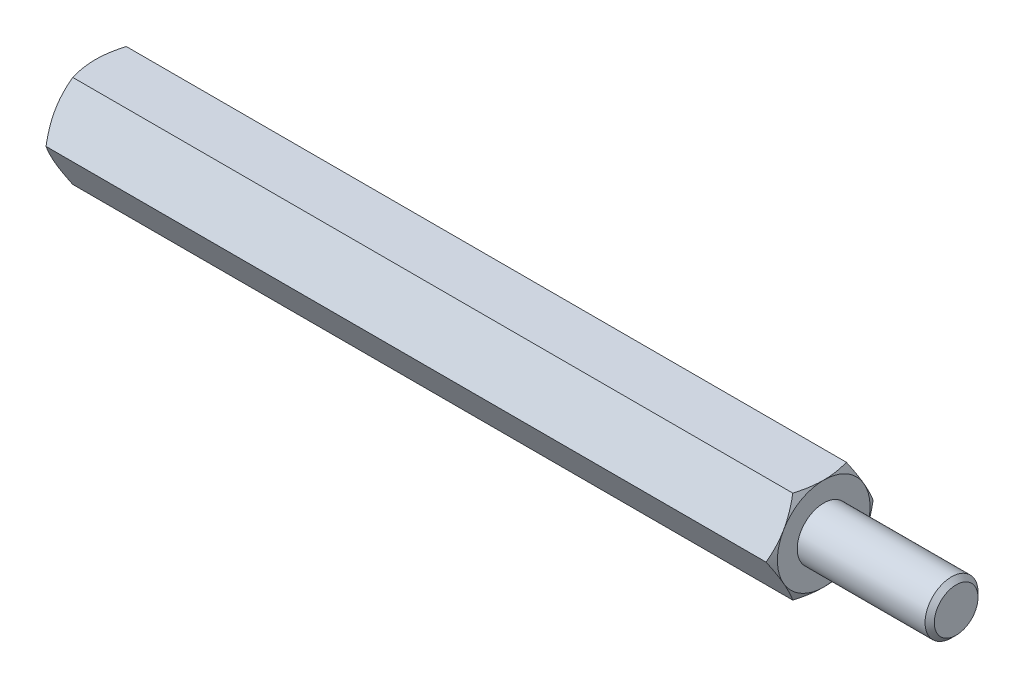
ISO-10303-21;
HEADER;
FILE_DESCRIPTION(('STEP AP214'),'2;1');
FILE_NAME('part.step','',(''),(''),'','','');
FILE_SCHEMA(('AUTOMOTIVE_DESIGN { 1 0 10303 214 1 1 1 1 }'));
ENDSEC;
DATA;
#1=APPLICATION_CONTEXT('core data for automotive mechanical design processes');
#2=APPLICATION_PROTOCOL_DEFINITION('international standard','automotive_design',2000,#1);
#3=PRODUCT_CONTEXT('',#1,'mechanical');
#4=PRODUCT('Part','Part','',(#3));
#5=PRODUCT_RELATED_PRODUCT_CATEGORY('part','',(#4));
#6=PRODUCT_DEFINITION_FORMATION('','',#4);
#7=PRODUCT_DEFINITION_CONTEXT('part definition',#1,'design');
#8=PRODUCT_DEFINITION('design','',#6,#7);
#9=PRODUCT_DEFINITION_SHAPE('','',#8);
#10=(LENGTH_UNIT() NAMED_UNIT(*) SI_UNIT(.MILLI.,.METRE.));
#11=(NAMED_UNIT(*) PLANE_ANGLE_UNIT() SI_UNIT($,.RADIAN.));
#12=(NAMED_UNIT(*) SI_UNIT($,.STERADIAN.) SOLID_ANGLE_UNIT());
#13=UNCERTAINTY_MEASURE_WITH_UNIT(LENGTH_MEASURE(1.E-05),#10,'distance_accuracy_value','');
#14=(GEOMETRIC_REPRESENTATION_CONTEXT(3) GLOBAL_UNCERTAINTY_ASSIGNED_CONTEXT((#13)) GLOBAL_UNIT_ASSIGNED_CONTEXT((#10,
#11,#12)) REPRESENTATION_CONTEXT('',''));
#15=CARTESIAN_POINT('',(0.,0.,0.));
#16=DIRECTION('',(0.,0.,1.));
#17=DIRECTION('',(1.,0.,0.));
#18=AXIS2_PLACEMENT_3D('',#15,#16,#17);
#19=CARTESIAN_POINT('',(27.5,3.5,-2.02072594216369));
#20=DIRECTION('',(1.,0.,0.));
#21=DIRECTION('',(0.,0.,-1.));
#22=AXIS2_PLACEMENT_3D('',#19,#20,#21);
#23=PLANE('',#22);
#24=CARTESIAN_POINT('',(27.5,0.,0.));
#25=DIRECTION('',(1.,0.,0.));
#26=DIRECTION('',(0.,0.,-1.));
#27=AXIS2_PLACEMENT_3D('',#24,#25,#26);
#28=CIRCLE('',#27,3.5);
#29=CARTESIAN_POINT('',(27.5,-1.75,-3.03108891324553));
#30=VERTEX_POINT('',#29);
#31=CARTESIAN_POINT('',(27.5,1.75,-3.03108891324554));
#32=VERTEX_POINT('',#31);
#33=EDGE_CURVE('E288',#30,#32,#28,.T.);
#34=ORIENTED_EDGE('',*,*,#33,.T.);
#35=CARTESIAN_POINT('',(27.5,3.5,0.));
#36=VERTEX_POINT('',#35);
#37=EDGE_CURVE('E53',#32,#36,#28,.T.);
#38=ORIENTED_EDGE('',*,*,#37,.T.);
#39=CARTESIAN_POINT('',(27.5,1.75,3.03108891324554));
#40=VERTEX_POINT('',#39);
#41=EDGE_CURVE('E297',#36,#40,#28,.T.);
#42=ORIENTED_EDGE('',*,*,#41,.T.);
#43=CARTESIAN_POINT('',(27.5,-1.75000000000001,3.03108891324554));
#44=VERTEX_POINT('',#43);
#45=EDGE_CURVE('E302',#40,#44,#28,.T.);
#46=ORIENTED_EDGE('',*,*,#45,.T.);
#47=CARTESIAN_POINT('',(27.5,0.,0.));
#48=DIRECTION('',(-1.,0.,0.));
#49=DIRECTION('',(0.,-1.,0.));
#50=AXIS2_PLACEMENT_3D('',#47,#48,#49);
#51=CIRCLE('',#50,3.5);
#52=CARTESIAN_POINT('',(27.5,-3.50000000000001,0.));
#53=VERTEX_POINT('',#52);
#54=EDGE_CURVE('E193',#53,#44,#51,.T.);
#55=ORIENTED_EDGE('',*,*,#54,.F.);
#56=EDGE_CURVE('E61',#53,#30,#28,.T.);
#57=ORIENTED_EDGE('',*,*,#56,.T.);
#58=EDGE_LOOP('',(#34,#38,#42,#46,#55,#57));
#59=FACE_BOUND('',#58,.T.);
#60=CARTESIAN_POINT('',(27.5,0.,0.));
#61=DIRECTION('',(1.,0.,0.));
#62=DIRECTION('',(0.,0.,-1.));
#63=AXIS2_PLACEMENT_3D('',#60,#61,#62);
#64=CIRCLE('',#63,2.);
#65=CARTESIAN_POINT('',(27.5,0.,-2.));
#66=VERTEX_POINT('',#65);
#67=EDGE_CURVE('E407',#66,#66,#64,.T.);
#68=ORIENTED_EDGE('',*,*,#67,.F.);
#69=EDGE_LOOP('',(#68));
#70=FACE_BOUND('',#69,.T.);
#71=ADVANCED_FACE('F37',(#59,#70),#23,.T.);
#72=CARTESIAN_POINT('',(27.5,0.,-4.04145188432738));
#73=DIRECTION('',(0.,-0.5,0.866025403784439));
#74=DIRECTION('',(0.,-0.866025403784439,-0.5));
#75=AXIS2_PLACEMENT_3D('',#72,#73,#74);
#76=PLANE('',#75);
#77=CARTESIAN_POINT('',(27.1873259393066,-0.000200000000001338,-4.04156735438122));
#78=CARTESIAN_POINT('',(27.23861421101,0.153607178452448,-3.9527667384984));
#79=CARTESIAN_POINT('',(27.2852590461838,0.308742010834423,-3.86319960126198));
#80=CARTESIAN_POINT('',(27.3666781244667,0.621698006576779,-3.68251437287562));
#81=CARTESIAN_POINT('',(27.4014235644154,0.779524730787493,-3.59139307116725));
#82=CARTESIAN_POINT('',(27.4555099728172,1.09322221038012,-3.41027974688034));
#83=CARTESIAN_POINT('',(27.4752109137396,1.24904469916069,-3.32031559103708));
#84=CARTESIAN_POINT('',(27.4987298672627,1.56142288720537,-3.13996396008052));
#85=CARTESIAN_POINT('',(27.5025673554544,1.71797745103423,-3.04957714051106));
#86=CARTESIAN_POINT('',(27.494584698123,2.01050921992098,-2.88068384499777));
#87=CARTESIAN_POINT('',(27.4847245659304,2.1465302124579,-2.80215208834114));
#88=CARTESIAN_POINT('',(27.4534735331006,2.41768602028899,-2.64560020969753));
#89=CARTESIAN_POINT('',(27.4320719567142,2.55281989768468,-2.5675806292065));
#90=CARTESIAN_POINT('',(27.3785695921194,2.82453479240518,-2.41070596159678));
#91=CARTESIAN_POINT('',(27.3462420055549,2.96108141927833,-2.33187072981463));
#92=CARTESIAN_POINT('',(27.272871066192,3.2321380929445,-2.17537608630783));
#93=CARTESIAN_POINT('',(27.2318449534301,3.36665161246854,-2.09771466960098));
#94=CARTESIAN_POINT('',(27.1873259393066,3.5002,-2.02061047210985));
#95=B_SPLINE_CURVE_WITH_KNOTS('',3,(#77,#78,#79,#80,#81,#82,#83,#84,#85,#86,#87,#88,#89,#90,#91,
#92,#93,#94),.UNSPECIFIED.,.F.,.F.,(4,2,2,2,2,2,2,2,4),(0.,0.554793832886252,1.11092123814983,
1.65328467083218,2.19498204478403,2.6666513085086,3.13875761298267,3.62133612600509,
4.10296698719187),.UNSPECIFIED.);
#96=CARTESIAN_POINT('',(27.1873926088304,0.,-4.04145188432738));
#97=VERTEX_POINT('',#96);
#98=EDGE_CURVE('E353',#97,#32,#95,.T.);
#99=ORIENTED_EDGE('',*,*,#98,.F.);
#100=DIRECTION('',(-1.,0.,0.));
#101=VECTOR('',#100,1.);
#102=CARTESIAN_POINT('',(27.5,0.,-4.04145188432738));
#103=LINE('',#102,#101);
#104=CARTESIAN_POINT('',(-27.1873926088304,0.,-4.04145188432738));
#105=VERTEX_POINT('',#104);
#106=EDGE_CURVE('E264',#97,#105,#103,.T.);
#107=ORIENTED_EDGE('',*,*,#106,.T.);
#108=CARTESIAN_POINT('',(-27.1873259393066,3.5002,-2.02061047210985));
#109=CARTESIAN_POINT('',(-27.23861421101,3.34639282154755,-2.10941108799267));
#110=CARTESIAN_POINT('',(-27.2852590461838,3.19125798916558,-2.19897822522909));
#111=CARTESIAN_POINT('',(-27.3666781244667,2.87830199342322,-2.37966345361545));
#112=CARTESIAN_POINT('',(-27.4014235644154,2.7204752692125,-2.47078475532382));
#113=CARTESIAN_POINT('',(-27.4555099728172,2.40677778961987,-2.65189807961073));
#114=CARTESIAN_POINT('',(-27.4752109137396,2.25095530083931,-2.74186223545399));
#115=CARTESIAN_POINT('',(-27.4987298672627,1.93857711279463,-2.92221386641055));
#116=CARTESIAN_POINT('',(-27.5025673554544,1.78202254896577,-3.01260068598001));
#117=CARTESIAN_POINT('',(-27.494584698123,1.48949078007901,-3.1814939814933));
#118=CARTESIAN_POINT('',(-27.4847245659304,1.35346978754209,-3.26002573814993));
#119=CARTESIAN_POINT('',(-27.4534735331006,1.082313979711,-3.41657761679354));
#120=CARTESIAN_POINT('',(-27.4320719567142,0.947180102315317,-3.49459719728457));
#121=CARTESIAN_POINT('',(-27.3785695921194,0.675465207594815,-3.65147186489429));
#122=CARTESIAN_POINT('',(-27.3462420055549,0.538918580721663,-3.73030709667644));
#123=CARTESIAN_POINT('',(-27.272871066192,0.267861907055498,-3.88680174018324));
#124=CARTESIAN_POINT('',(-27.2318449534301,0.133348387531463,-3.96446315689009));
#125=CARTESIAN_POINT('',(-27.1873259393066,-0.000200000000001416,-4.04156735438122));
#126=B_SPLINE_CURVE_WITH_KNOTS('',3,(#108,#109,#110,#111,#112,#113,#114,#115,#116,#117,#118,
#119,#120,#121,#122,#123,#124,#125),.UNSPECIFIED.,.F.,.F.,(4,2,2,2,2,2,2,2,4),(0.,
0.554793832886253,1.11092123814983,1.65328467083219,2.19498204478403,2.6666513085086,
3.13875761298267,3.6213361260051,4.10296698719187),.UNSPECIFIED.);
#127=CARTESIAN_POINT('',(-27.5,1.75,-3.03108891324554));
#128=VERTEX_POINT('',#127);
#129=EDGE_CURVE('E322',#128,#105,#126,.T.);
#130=ORIENTED_EDGE('',*,*,#129,.F.);
#131=CARTESIAN_POINT('',(-27.1873926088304,3.5,-2.02072594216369));
#132=VERTEX_POINT('',#131);
#133=EDGE_CURVE('E320',#132,#128,#126,.T.);
#134=ORIENTED_EDGE('',*,*,#133,.F.);
#135=DIRECTION('',(-1.,0.,0.));
#136=VECTOR('',#135,1.);
#137=CARTESIAN_POINT('',(27.5,3.5,-2.02072594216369));
#138=LINE('',#137,#136);
#139=CARTESIAN_POINT('',(27.1873926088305,3.5,-2.02072594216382));
#140=VERTEX_POINT('',#139);
#141=EDGE_CURVE('E279',#140,#132,#138,.T.);
#142=ORIENTED_EDGE('',*,*,#141,.F.);
#143=EDGE_CURVE('E229',#32,#140,#95,.T.);
#144=ORIENTED_EDGE('',*,*,#143,.F.);
#145=EDGE_LOOP('',(#99,#107,#130,#134,#142,#144));
#146=FACE_BOUND('',#145,.T.);
#147=ADVANCED_FACE('F148',(#146),#76,.F.);
#148=CARTESIAN_POINT('',(27.5,3.5,-2.02072594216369));
#149=DIRECTION('',(0.,-1.,0.));
#150=DIRECTION('',(0.,0.,-1.));
#151=AXIS2_PLACEMENT_3D('',#148,#149,#150);
#152=PLANE('',#151);
#153=CARTESIAN_POINT('',(25.7443294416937,3.5,-5.525713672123));
#154=CARTESIAN_POINT('',(25.8192813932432,3.5,-5.37200190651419));
#155=CARTESIAN_POINT('',(25.8935424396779,3.5,-5.21794762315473));
#156=CARTESIAN_POINT('',(26.0402960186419,3.5,-4.90897223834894));
#157=CARTESIAN_POINT('',(26.1127882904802,3.5,-4.75405101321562));
#158=CARTESIAN_POINT('',(26.2559617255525,3.5,-4.44240758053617));
#159=CARTESIAN_POINT('',(26.3266316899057,3.5,-4.28568021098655));
#160=CARTESIAN_POINT('',(26.4652074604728,3.5,-3.97101270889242));
#161=CARTESIAN_POINT('',(26.5331133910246,3.5,-3.81307263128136));
#162=CARTESIAN_POINT('',(26.6677143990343,3.5,-3.49026114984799));
#163=CARTESIAN_POINT('',(26.7342871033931,3.5,-3.32533845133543));
#164=CARTESIAN_POINT('',(26.8626267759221,3.5,-2.99359992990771));
#165=CARTESIAN_POINT('',(26.9243932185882,3.5,-2.82678390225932));
#166=CARTESIAN_POINT('',(27.0415700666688,3.5,-2.49127529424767));
#167=CARTESIAN_POINT('',(27.0969925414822,3.5,-2.32258697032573));
#168=CARTESIAN_POINT('',(27.1997679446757,3.5,-1.98279215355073));
#169=CARTESIAN_POINT('',(27.2471233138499,3.5,-1.81168640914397));
#170=CARTESIAN_POINT('',(27.3312987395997,3.5,-1.46793354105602));
#171=CARTESIAN_POINT('',(27.3681796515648,3.5,-1.2953015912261));
#172=CARTESIAN_POINT('',(27.4293955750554,3.5,-0.94779164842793));
#173=CARTESIAN_POINT('',(27.453731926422,3.5,-0.772913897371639));
#174=CARTESIAN_POINT('',(27.4876038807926,3.5,-0.424108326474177));
#175=CARTESIAN_POINT('',(27.497337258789,3.5,-0.250200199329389));
#176=CARTESIAN_POINT('',(27.5017053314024,3.5,0.0978233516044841));
#177=CARTESIAN_POINT('',(27.4963399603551,3.5,0.271938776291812));
#178=CARTESIAN_POINT('',(27.4750118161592,3.5,0.564711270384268));
#179=CARTESIAN_POINT('',(27.4628919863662,3.5,0.683667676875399));
#180=CARTESIAN_POINT('',(27.4323080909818,3.5,0.920767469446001));
#181=CARTESIAN_POINT('',(27.4138432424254,3.5,1.03891075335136));
#182=CARTESIAN_POINT('',(27.3498956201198,3.5,1.39193174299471));
#183=CARTESIAN_POINT('',(27.2958695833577,3.5,1.62528232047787));
#184=CARTESIAN_POINT('',(27.2014515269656,3.5,1.97433825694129));
#185=CARTESIAN_POINT('',(27.1672900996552,3.5,2.09183268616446));
#186=CARTESIAN_POINT('',(27.095234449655,3.5,2.32568238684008));
#187=CARTESIAN_POINT('',(27.0573401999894,3.5,2.44203765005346));
#188=CARTESIAN_POINT('',(26.9784421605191,3.5,2.6736423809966));
#189=CARTESIAN_POINT('',(26.9374392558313,3.5,2.78889215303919));
#190=CARTESIAN_POINT('',(26.852824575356,3.5,3.01842460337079));
#191=CARTESIAN_POINT('',(26.8092128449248,3.5,3.1327072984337));
#192=CARTESIAN_POINT('',(26.6958241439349,3.5,3.42150510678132));
#193=CARTESIAN_POINT('',(26.6245636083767,3.5,3.59543696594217));
#194=CARTESIAN_POINT('',(26.4781026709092,3.5,3.94163961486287));
#195=CARTESIAN_POINT('',(26.4029019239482,3.5,4.11391025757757));
#196=CARTESIAN_POINT('',(26.2494252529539,3.5,4.45713072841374));
#197=CARTESIAN_POINT('',(26.1711484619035,3.5,4.62808016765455));
#198=CARTESIAN_POINT('',(26.012188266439,3.5,4.9688584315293));
#199=CARTESIAN_POINT('',(25.9315047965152,3.5,5.13868722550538));
#200=CARTESIAN_POINT('',(25.6863871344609,3.5,5.64726192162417));
#201=CARTESIAN_POINT('',(25.5190975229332,3.5,5.98463020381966));
#202=CARTESIAN_POINT('',(25.1795854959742,3.5,6.65678495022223));
#203=CARTESIAN_POINT('',(25.0073639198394,3.5,6.99157184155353));
#204=CARTESIAN_POINT('',(24.6760800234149,3.5,7.62749570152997));
#205=CARTESIAN_POINT('',(24.5173299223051,3.5,7.92879562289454));
#206=CARTESIAN_POINT('',(24.1977473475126,3.5,8.53030635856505));
#207=CARTESIAN_POINT('',(24.0369147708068,3.5,8.83051711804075));
#208=CARTESIAN_POINT('',(23.7141792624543,3.5,9.42918006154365));
#209=CARTESIAN_POINT('',(23.5522810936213,3.5,9.72763481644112));
#210=CARTESIAN_POINT('',(23.2272737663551,3.5,10.3238577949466));
#211=CARTESIAN_POINT('',(23.0641646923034,3.5,10.6216260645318));
#212=CARTESIAN_POINT('',(22.9006104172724,3.5,10.9191478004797));
#213=B_SPLINE_CURVE_WITH_KNOTS('',3,(#153,#154,#155,#156,#157,#158,#159,#160,#161,#162,#163,
#164,#165,#166,#167,#168,#169,#170,#171,#172,#173,#174,#175,#176,#177,#178,#179,#180,#181,#182,
#183,#184,#185,#186,#187,#188,#189,#190,#191,#192,#193,#194,#195,#196,#197,#198,#199,#200,#201,
#202,#203,#204,#205,#206,#207,#208,#209,#210,#211,#212),.UNSPECIFIED.,.F.,.F.,(4,2,2,2,2,2,2,2,
2,2,2,2,2,2,2,2,2,2,2,2,2,2,2,2,2,2,2,2,2,4),(0.,0.513041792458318,1.02615874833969,
1.54190801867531,2.05763406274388,2.59113284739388,3.1246898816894,3.65721433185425,
4.18957737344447,4.71878103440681,5.24792816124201,5.76984197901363,6.29175806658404,
6.65030258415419,7.00889136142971,7.72642330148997,8.09346920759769,8.46051776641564,
8.82746220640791,9.19440026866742,9.7582223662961,10.3220939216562,10.8861255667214,
11.4501725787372,12.579801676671,13.7092396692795,14.730918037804,15.7526471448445,
16.771258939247,17.7898004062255),.UNSPECIFIED.);
#214=EDGE_CURVE('E227',#140,#36,#213,.T.);
#215=ORIENTED_EDGE('',*,*,#214,.F.);
#216=ORIENTED_EDGE('',*,*,#141,.T.);
#217=CARTESIAN_POINT('',(-25.7443294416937,3.5,-5.525713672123));
#218=CARTESIAN_POINT('',(-25.8192813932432,3.5,-5.37200190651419));
#219=CARTESIAN_POINT('',(-25.8935424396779,3.5,-5.21794762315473));
#220=CARTESIAN_POINT('',(-26.0402960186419,3.5,-4.90897223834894));
#221=CARTESIAN_POINT('',(-26.1127882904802,3.5,-4.75405101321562));
#222=CARTESIAN_POINT('',(-26.2559617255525,3.5,-4.44240758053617));
#223=CARTESIAN_POINT('',(-26.3266316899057,3.5,-4.28568021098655));
#224=CARTESIAN_POINT('',(-26.4652074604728,3.5,-3.97101270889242));
#225=CARTESIAN_POINT('',(-26.5331133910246,3.5,-3.81307263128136));
#226=CARTESIAN_POINT('',(-26.6677143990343,3.5,-3.49026114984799));
#227=CARTESIAN_POINT('',(-26.7342871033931,3.5,-3.32533845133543));
#228=CARTESIAN_POINT('',(-26.8626267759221,3.5,-2.99359992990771));
#229=CARTESIAN_POINT('',(-26.9243932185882,3.5,-2.82678390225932));
#230=CARTESIAN_POINT('',(-27.0415700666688,3.5,-2.49127529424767));
#231=CARTESIAN_POINT('',(-27.0969925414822,3.5,-2.32258697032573));
#232=CARTESIAN_POINT('',(-27.1997679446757,3.5,-1.98279215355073));
#233=CARTESIAN_POINT('',(-27.2471233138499,3.5,-1.81168640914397));
#234=CARTESIAN_POINT('',(-27.3312987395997,3.5,-1.46793354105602));
#235=CARTESIAN_POINT('',(-27.3681796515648,3.5,-1.2953015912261));
#236=CARTESIAN_POINT('',(-27.4293955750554,3.5,-0.94779164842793));
#237=CARTESIAN_POINT('',(-27.453731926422,3.5,-0.772913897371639));
#238=CARTESIAN_POINT('',(-27.4876038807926,3.5,-0.424108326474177));
#239=CARTESIAN_POINT('',(-27.497337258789,3.5,-0.250200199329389));
#240=CARTESIAN_POINT('',(-27.5017053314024,3.5,0.0978233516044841));
#241=CARTESIAN_POINT('',(-27.4963399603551,3.5,0.271938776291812));
#242=CARTESIAN_POINT('',(-27.4750118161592,3.5,0.564711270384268));
#243=CARTESIAN_POINT('',(-27.4628919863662,3.5,0.683667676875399));
#244=CARTESIAN_POINT('',(-27.4323080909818,3.5,0.920767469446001));
#245=CARTESIAN_POINT('',(-27.4138432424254,3.5,1.03891075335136));
#246=CARTESIAN_POINT('',(-27.3498956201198,3.5,1.39193174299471));
#247=CARTESIAN_POINT('',(-27.2958695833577,3.5,1.62528232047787));
#248=CARTESIAN_POINT('',(-27.2014515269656,3.5,1.97433825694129));
#249=CARTESIAN_POINT('',(-27.1672900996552,3.5,2.09183268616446));
#250=CARTESIAN_POINT('',(-27.095234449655,3.5,2.32568238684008));
#251=CARTESIAN_POINT('',(-27.0573401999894,3.5,2.44203765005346));
#252=CARTESIAN_POINT('',(-26.9784421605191,3.5,2.6736423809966));
#253=CARTESIAN_POINT('',(-26.9374392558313,3.5,2.78889215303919));
#254=CARTESIAN_POINT('',(-26.852824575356,3.5,3.01842460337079));
#255=CARTESIAN_POINT('',(-26.8092128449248,3.5,3.1327072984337));
#256=CARTESIAN_POINT('',(-26.6958241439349,3.5,3.42150510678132));
#257=CARTESIAN_POINT('',(-26.6245636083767,3.5,3.59543696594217));
#258=CARTESIAN_POINT('',(-26.4781026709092,3.5,3.94163961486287));
#259=CARTESIAN_POINT('',(-26.4029019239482,3.5,4.11391025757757));
#260=CARTESIAN_POINT('',(-26.2494252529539,3.5,4.45713072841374));
#261=CARTESIAN_POINT('',(-26.1711484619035,3.5,4.62808016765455));
#262=CARTESIAN_POINT('',(-26.012188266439,3.5,4.9688584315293));
#263=CARTESIAN_POINT('',(-25.9315047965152,3.5,5.13868722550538));
#264=CARTESIAN_POINT('',(-25.6863871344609,3.5,5.64726192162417));
#265=CARTESIAN_POINT('',(-25.5190975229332,3.5,5.98463020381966));
#266=CARTESIAN_POINT('',(-25.1795854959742,3.5,6.65678495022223));
#267=CARTESIAN_POINT('',(-25.0073639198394,3.5,6.99157184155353));
#268=CARTESIAN_POINT('',(-24.6760800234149,3.5,7.62749570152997));
#269=CARTESIAN_POINT('',(-24.5173299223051,3.5,7.92879562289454));
#270=CARTESIAN_POINT('',(-24.1977473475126,3.5,8.53030635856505));
#271=CARTESIAN_POINT('',(-24.0369147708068,3.5,8.83051711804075));
#272=CARTESIAN_POINT('',(-23.7141792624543,3.5,9.42918006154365));
#273=CARTESIAN_POINT('',(-23.5522810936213,3.5,9.72763481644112));
#274=CARTESIAN_POINT('',(-23.2272737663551,3.5,10.3238577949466));
#275=CARTESIAN_POINT('',(-23.0641646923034,3.5,10.6216260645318));
#276=CARTESIAN_POINT('',(-22.9006104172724,3.5,10.9191478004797));
#277=B_SPLINE_CURVE_WITH_KNOTS('',3,(#217,#218,#219,#220,#221,#222,#223,#224,#225,#226,#227,
#228,#229,#230,#231,#232,#233,#234,#235,#236,#237,#238,#239,#240,#241,#242,#243,#244,#245,#246,
#247,#248,#249,#250,#251,#252,#253,#254,#255,#256,#257,#258,#259,#260,#261,#262,#263,#264,#265,
#266,#267,#268,#269,#270,#271,#272,#273,#274,#275,#276),.UNSPECIFIED.,.F.,.F.,(4,2,2,2,2,2,2,2,
2,2,2,2,2,2,2,2,2,2,2,2,2,2,2,2,2,2,2,2,2,4),(0.,0.513041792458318,1.02615874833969,
1.54190801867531,2.05763406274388,2.59113284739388,3.1246898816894,3.65721433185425,
4.18957737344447,4.71878103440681,5.24792816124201,5.76984197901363,6.29175806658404,
6.65030258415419,7.00889136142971,7.72642330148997,8.09346920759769,8.46051776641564,
8.82746220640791,9.19440026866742,9.7582223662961,10.3220939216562,10.8861255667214,
11.4501725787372,12.579801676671,13.7092396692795,14.730918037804,15.7526471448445,
16.771258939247,17.7898004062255),.UNSPECIFIED.);
#278=CARTESIAN_POINT('',(-27.5,3.5,0.));
#279=VERTEX_POINT('',#278);
#280=EDGE_CURVE('E241',#279,#132,#277,.F.);
#281=ORIENTED_EDGE('',*,*,#280,.F.);
#282=CARTESIAN_POINT('',(-27.1873926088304,3.5,2.02072594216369));
#283=VERTEX_POINT('',#282);
#284=EDGE_CURVE('E249',#283,#279,#277,.F.);
#285=ORIENTED_EDGE('',*,*,#284,.F.);
#286=DIRECTION('',(-1.,0.,0.));
#287=VECTOR('',#286,1.);
#288=CARTESIAN_POINT('',(27.5,3.5,2.02072594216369));
#289=LINE('',#288,#287);
#290=CARTESIAN_POINT('',(27.1873926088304,3.5,2.02072594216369));
#291=VERTEX_POINT('',#290);
#292=EDGE_CURVE('E276',#291,#283,#289,.T.);
#293=ORIENTED_EDGE('',*,*,#292,.F.);
#294=EDGE_CURVE('E221',#36,#291,#213,.T.);
#295=ORIENTED_EDGE('',*,*,#294,.F.);
#296=EDGE_LOOP('',(#215,#216,#281,#285,#293,#295));
#297=FACE_BOUND('',#296,.T.);
#298=ADVANCED_FACE('F153',(#297),#152,.F.);
#299=CARTESIAN_POINT('',(27.5,3.5,2.02072594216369));
#300=DIRECTION('',(0.,-0.5,-0.866025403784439));
#301=DIRECTION('',(0.,0.866025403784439,-0.5));
#302=AXIS2_PLACEMENT_3D('',#299,#300,#301);
#303=PLANE('',#302);
#304=CARTESIAN_POINT('',(27.1873259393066,3.5002,2.02061047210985));
#305=CARTESIAN_POINT('',(27.23861421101,3.34639282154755,2.10941108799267));
#306=CARTESIAN_POINT('',(27.2852590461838,3.19125798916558,2.19897822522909));
#307=CARTESIAN_POINT('',(27.3666781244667,2.87830199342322,2.37966345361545));
#308=CARTESIAN_POINT('',(27.4014235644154,2.7204752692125,2.47078475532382));
#309=CARTESIAN_POINT('',(27.4555099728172,2.40677778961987,2.65189807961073));
#310=CARTESIAN_POINT('',(27.4752109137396,2.25095530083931,2.74186223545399));
#311=CARTESIAN_POINT('',(27.4987298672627,1.93857711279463,2.92221386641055));
#312=CARTESIAN_POINT('',(27.5025673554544,1.78202254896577,3.01260068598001));
#313=CARTESIAN_POINT('',(27.494584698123,1.48949078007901,3.1814939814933));
#314=CARTESIAN_POINT('',(27.4847245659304,1.35346978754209,3.26002573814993));
#315=CARTESIAN_POINT('',(27.4534735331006,1.082313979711,3.41657761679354));
#316=CARTESIAN_POINT('',(27.4320719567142,0.947180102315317,3.49459719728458));
#317=CARTESIAN_POINT('',(27.3785695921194,0.675465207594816,3.65147186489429));
#318=CARTESIAN_POINT('',(27.3462420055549,0.538918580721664,3.73030709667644));
#319=CARTESIAN_POINT('',(27.272871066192,0.267861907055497,3.88680174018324));
#320=CARTESIAN_POINT('',(27.2318449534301,0.133348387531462,3.96446315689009));
#321=CARTESIAN_POINT('',(27.1873259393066,-0.00020000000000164,4.04156735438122));
#322=B_SPLINE_CURVE_WITH_KNOTS('',3,(#304,#305,#306,#307,#308,#309,#310,#311,#312,#313,#314,
#315,#316,#317,#318,#319,#320,#321),.UNSPECIFIED.,.F.,.F.,(4,2,2,2,2,2,2,2,4),(0.,
0.554793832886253,1.11092123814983,1.65328467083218,2.19498204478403,2.6666513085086,
3.13875761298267,3.62133612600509,4.10296698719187),.UNSPECIFIED.);
#323=EDGE_CURVE('E228',#291,#40,#322,.T.);
#324=ORIENTED_EDGE('',*,*,#323,.F.);
#325=ORIENTED_EDGE('',*,*,#292,.T.);
#326=CARTESIAN_POINT('',(-27.1873259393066,-0.000200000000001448,4.04156735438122));
#327=CARTESIAN_POINT('',(-27.23861421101,0.153607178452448,3.9527667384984));
#328=CARTESIAN_POINT('',(-27.2852590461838,0.308742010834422,3.86319960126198));
#329=CARTESIAN_POINT('',(-27.3666781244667,0.621698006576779,3.68251437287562));
#330=CARTESIAN_POINT('',(-27.4014235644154,0.779524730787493,3.59139307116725));
#331=CARTESIAN_POINT('',(-27.4555099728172,1.09322221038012,3.41027974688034));
#332=CARTESIAN_POINT('',(-27.4752109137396,1.24904469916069,3.32031559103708));
#333=CARTESIAN_POINT('',(-27.4987298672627,1.56142288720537,3.13996396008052));
#334=CARTESIAN_POINT('',(-27.5025673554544,1.71797745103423,3.04957714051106));
#335=CARTESIAN_POINT('',(-27.494584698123,2.01050921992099,2.88068384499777));
#336=CARTESIAN_POINT('',(-27.4847245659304,2.1465302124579,2.80215208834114));
#337=CARTESIAN_POINT('',(-27.4534735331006,2.41768602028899,2.64560020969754));
#338=CARTESIAN_POINT('',(-27.4320719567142,2.55281989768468,2.5675806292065));
#339=CARTESIAN_POINT('',(-27.3785695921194,2.82453479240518,2.41070596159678));
#340=CARTESIAN_POINT('',(-27.3462420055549,2.96108141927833,2.33187072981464));
#341=CARTESIAN_POINT('',(-27.272871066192,3.2321380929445,2.17537608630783));
#342=CARTESIAN_POINT('',(-27.2318449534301,3.36665161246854,2.09771466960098));
#343=CARTESIAN_POINT('',(-27.1873259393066,3.5002,2.02061047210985));
#344=B_SPLINE_CURVE_WITH_KNOTS('',3,(#326,#327,#328,#329,#330,#331,#332,#333,#334,#335,#336,
#337,#338,#339,#340,#341,#342,#343),.UNSPECIFIED.,.F.,.F.,(4,2,2,2,2,2,2,2,4),(0.,
0.554793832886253,1.11092123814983,1.65328467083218,2.19498204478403,2.6666513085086,
3.13875761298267,3.62133612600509,4.10296698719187),.UNSPECIFIED.);
#345=CARTESIAN_POINT('',(-27.5,1.75,3.03108891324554));
#346=VERTEX_POINT('',#345);
#347=EDGE_CURVE('E255',#346,#283,#344,.T.);
#348=ORIENTED_EDGE('',*,*,#347,.F.);
#349=CARTESIAN_POINT('',(-27.1873926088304,0.,4.04145188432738));
#350=VERTEX_POINT('',#349);
#351=EDGE_CURVE('E262',#350,#346,#344,.T.);
#352=ORIENTED_EDGE('',*,*,#351,.F.);
#353=DIRECTION('',(-1.,0.,0.));
#354=VECTOR('',#353,1.);
#355=CARTESIAN_POINT('',(27.5,0.,4.04145188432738));
#356=LINE('',#355,#354);
#357=CARTESIAN_POINT('',(27.1873926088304,0.,4.04145188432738));
#358=VERTEX_POINT('',#357);
#359=EDGE_CURVE('E273',#358,#350,#356,.T.);
#360=ORIENTED_EDGE('',*,*,#359,.F.);
#361=EDGE_CURVE('E215',#40,#358,#322,.T.);
#362=ORIENTED_EDGE('',*,*,#361,.F.);
#363=EDGE_LOOP('',(#324,#325,#348,#352,#360,#362));
#364=FACE_BOUND('',#363,.T.);
#365=ADVANCED_FACE('F235',(#364),#303,.F.);
#366=CARTESIAN_POINT('',(27.5,0.,4.04145188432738));
#367=DIRECTION('',(0.,0.5,-0.866025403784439));
#368=DIRECTION('',(0.,0.866025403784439,0.5));
#369=AXIS2_PLACEMENT_3D('',#366,#367,#368);
#370=PLANE('',#369);
#371=CARTESIAN_POINT('',(27.1873259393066,0.000199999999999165,4.04156735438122));
#372=CARTESIAN_POINT('',(27.23861421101,-0.153607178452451,3.9527667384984));
#373=CARTESIAN_POINT('',(27.2852590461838,-0.308742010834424,3.86319960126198));
#374=CARTESIAN_POINT('',(27.3666781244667,-0.621698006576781,3.68251437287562));
#375=CARTESIAN_POINT('',(27.4014235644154,-0.779524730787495,3.59139307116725));
#376=CARTESIAN_POINT('',(27.4555099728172,-1.09322221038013,3.41027974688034));
#377=CARTESIAN_POINT('',(27.4752109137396,-1.24904469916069,3.32031559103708));
#378=CARTESIAN_POINT('',(27.4987298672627,-1.56142288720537,3.13996396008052));
#379=CARTESIAN_POINT('',(27.5025673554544,-1.71797745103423,3.04957714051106));
#380=CARTESIAN_POINT('',(27.494584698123,-2.01050921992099,2.88068384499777));
#381=CARTESIAN_POINT('',(27.4847245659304,-2.1465302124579,2.80215208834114));
#382=CARTESIAN_POINT('',(27.4534735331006,-2.41768602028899,2.64560020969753));
#383=CARTESIAN_POINT('',(27.4320719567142,-2.55281989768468,2.5675806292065));
#384=CARTESIAN_POINT('',(27.3785695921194,-2.82453479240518,2.41070596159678));
#385=CARTESIAN_POINT('',(27.3462420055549,-2.96108141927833,2.33187072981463));
#386=CARTESIAN_POINT('',(27.272871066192,-3.2321380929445,2.17537608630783));
#387=CARTESIAN_POINT('',(27.2318449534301,-3.36665161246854,2.09771466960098));
#388=CARTESIAN_POINT('',(27.1873259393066,-3.5002,2.02061047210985));
#389=B_SPLINE_CURVE_WITH_KNOTS('',3,(#371,#372,#373,#374,#375,#376,#377,#378,#379,#380,#381,
#382,#383,#384,#385,#386,#387,#388),.UNSPECIFIED.,.F.,.F.,(4,2,2,2,2,2,2,2,4),(0.,
0.554793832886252,1.11092123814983,1.65328467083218,2.19498204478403,2.66665130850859,
3.13875761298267,3.62133612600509,4.10296698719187),.UNSPECIFIED.);
#390=EDGE_CURVE('E317',#358,#44,#389,.T.);
#391=ORIENTED_EDGE('',*,*,#390,.F.);
#392=ORIENTED_EDGE('',*,*,#359,.T.);
#393=CARTESIAN_POINT('',(-27.1873259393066,-3.5002,2.02061047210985));
#394=CARTESIAN_POINT('',(-27.23861421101,-3.34639282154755,2.10941108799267));
#395=CARTESIAN_POINT('',(-27.2852590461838,-3.19125798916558,2.19897822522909));
#396=CARTESIAN_POINT('',(-27.3666781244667,-2.87830199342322,2.37966345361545));
#397=CARTESIAN_POINT('',(-27.4014235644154,-2.72047526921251,2.47078475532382));
#398=CARTESIAN_POINT('',(-27.4555099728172,-2.40677778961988,2.65189807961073));
#399=CARTESIAN_POINT('',(-27.4752109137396,-2.25095530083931,2.74186223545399));
#400=CARTESIAN_POINT('',(-27.4987298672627,-1.93857711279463,2.92221386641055));
#401=CARTESIAN_POINT('',(-27.5025673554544,-1.78202254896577,3.01260068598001));
#402=CARTESIAN_POINT('',(-27.494584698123,-1.48949078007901,3.1814939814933));
#403=CARTESIAN_POINT('',(-27.4847245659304,-1.3534697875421,3.26002573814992));
#404=CARTESIAN_POINT('',(-27.4534735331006,-1.08231397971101,3.41657761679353));
#405=CARTESIAN_POINT('',(-27.4320719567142,-0.94718010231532,3.49459719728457));
#406=CARTESIAN_POINT('',(-27.3785695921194,-0.675465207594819,3.65147186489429));
#407=CARTESIAN_POINT('',(-27.3462420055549,-0.538918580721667,3.73030709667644));
#408=CARTESIAN_POINT('',(-27.272871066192,-0.2678619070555,3.88680174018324));
#409=CARTESIAN_POINT('',(-27.2318449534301,-0.133348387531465,3.96446315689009));
#410=CARTESIAN_POINT('',(-27.1873259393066,0.000199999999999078,4.04156735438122));
#411=B_SPLINE_CURVE_WITH_KNOTS('',3,(#393,#394,#395,#396,#397,#398,#399,#400,#401,#402,#403,
#404,#405,#406,#407,#408,#409,#410),.UNSPECIFIED.,.F.,.F.,(4,2,2,2,2,2,2,2,4),(0.,
0.554793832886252,1.11092123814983,1.65328467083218,2.19498204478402,2.66665130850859,
3.13875761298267,3.62133612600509,4.10296698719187),.UNSPECIFIED.);
#412=CARTESIAN_POINT('',(-27.5,-1.75000000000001,3.03108891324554));
#413=VERTEX_POINT('',#412);
#414=EDGE_CURVE('E263',#413,#350,#411,.T.);
#415=ORIENTED_EDGE('',*,*,#414,.F.);
#416=CARTESIAN_POINT('',(-27.1873926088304,-3.5,2.02072594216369));
#417=VERTEX_POINT('',#416);
#418=EDGE_CURVE('E250',#417,#413,#411,.T.);
#419=ORIENTED_EDGE('',*,*,#418,.F.);
#420=DIRECTION('',(-1.,0.,0.));
#421=VECTOR('',#420,1.);
#422=CARTESIAN_POINT('',(27.5,-3.5,2.02072594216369));
#423=LINE('',#422,#421);
#424=CARTESIAN_POINT('',(27.1873926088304,-3.5,2.02072594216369));
#425=VERTEX_POINT('',#424);
#426=EDGE_CURVE('E270',#425,#417,#423,.T.);
#427=ORIENTED_EDGE('',*,*,#426,.F.);
#428=EDGE_CURVE('E210',#44,#425,#389,.T.);
#429=ORIENTED_EDGE('',*,*,#428,.F.);
#430=EDGE_LOOP('',(#391,#392,#415,#419,#427,#429));
#431=FACE_BOUND('',#430,.T.);
#432=ADVANCED_FACE('F436',(#431),#370,.F.);
#433=CARTESIAN_POINT('',(27.5,-3.5,2.02072594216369));
#434=DIRECTION('',(0.,1.,0.));
#435=DIRECTION('',(0.,0.,1.));
#436=AXIS2_PLACEMENT_3D('',#433,#434,#435);
#437=PLANE('',#436);
#438=CARTESIAN_POINT('',(25.7443294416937,-3.5,-5.525713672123));
#439=CARTESIAN_POINT('',(25.8192813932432,-3.5,-5.37200190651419));
#440=CARTESIAN_POINT('',(25.8935424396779,-3.5,-5.21794762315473));
#441=CARTESIAN_POINT('',(26.0402960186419,-3.5,-4.90897223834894));
#442=CARTESIAN_POINT('',(26.1127882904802,-3.5,-4.75405101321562));
#443=CARTESIAN_POINT('',(26.2559617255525,-3.5,-4.44240758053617));
#444=CARTESIAN_POINT('',(26.3266316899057,-3.5,-4.28568021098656));
#445=CARTESIAN_POINT('',(26.4652074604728,-3.5,-3.97101270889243));
#446=CARTESIAN_POINT('',(26.5331133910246,-3.5,-3.81307263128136));
#447=CARTESIAN_POINT('',(26.6677143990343,-3.5,-3.49026114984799));
#448=CARTESIAN_POINT('',(26.7342871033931,-3.5,-3.32533845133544));
#449=CARTESIAN_POINT('',(26.8626267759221,-3.5,-2.99359992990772));
#450=CARTESIAN_POINT('',(26.9243932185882,-3.5,-2.82678390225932));
#451=CARTESIAN_POINT('',(27.0415700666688,-3.5,-2.49127529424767));
#452=CARTESIAN_POINT('',(27.0969925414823,-3.5,-2.32258697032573));
#453=CARTESIAN_POINT('',(27.1997679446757,-3.5,-1.98279215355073));
#454=CARTESIAN_POINT('',(27.2471233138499,-3.5,-1.81168640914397));
#455=CARTESIAN_POINT('',(27.3312987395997,-3.5,-1.46793354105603));
#456=CARTESIAN_POINT('',(27.3681796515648,-3.5,-1.2953015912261));
#457=CARTESIAN_POINT('',(27.4293955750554,-3.5,-0.947791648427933));
#458=CARTESIAN_POINT('',(27.453731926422,-3.5,-0.772913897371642));
#459=CARTESIAN_POINT('',(27.4876038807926,-3.5,-0.42410832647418));
#460=CARTESIAN_POINT('',(27.497337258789,-3.5,-0.250200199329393));
#461=CARTESIAN_POINT('',(27.5017053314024,-3.5,0.0978233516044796));
#462=CARTESIAN_POINT('',(27.4963399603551,-3.5,0.271938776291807));
#463=CARTESIAN_POINT('',(27.4750118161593,-3.5,0.564711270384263));
#464=CARTESIAN_POINT('',(27.4628919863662,-3.5,0.683667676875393));
#465=CARTESIAN_POINT('',(27.4323080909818,-3.5,0.920767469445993));
#466=CARTESIAN_POINT('',(27.4138432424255,-3.5,1.03891075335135));
#467=CARTESIAN_POINT('',(27.3498956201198,-3.5,1.39193174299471));
#468=CARTESIAN_POINT('',(27.2958695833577,-3.5,1.62528232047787));
#469=CARTESIAN_POINT('',(27.2014515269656,-3.5,1.97433825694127));
#470=CARTESIAN_POINT('',(27.1672900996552,-3.5,2.09183268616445));
#471=CARTESIAN_POINT('',(27.095234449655,-3.5,2.32568238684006));
#472=CARTESIAN_POINT('',(27.0573401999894,-3.5,2.44203765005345));
#473=CARTESIAN_POINT('',(26.9784421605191,-3.5,2.67364238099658));
#474=CARTESIAN_POINT('',(26.9374392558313,-3.5,2.78889215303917));
#475=CARTESIAN_POINT('',(26.852824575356,-3.5,3.01842460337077));
#476=CARTESIAN_POINT('',(26.8092128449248,-3.5,3.13270729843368));
#477=CARTESIAN_POINT('',(26.6958241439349,-3.5,3.4215051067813));
#478=CARTESIAN_POINT('',(26.6245636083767,-3.5,3.59543696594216));
#479=CARTESIAN_POINT('',(26.4781026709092,-3.5,3.94163961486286));
#480=CARTESIAN_POINT('',(26.4029019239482,-3.5,4.11391025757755));
#481=CARTESIAN_POINT('',(26.2494252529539,-3.5,4.45713072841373));
#482=CARTESIAN_POINT('',(26.1711484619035,-3.5,4.62808016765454));
#483=CARTESIAN_POINT('',(26.0121882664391,-3.5,4.96885843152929));
#484=CARTESIAN_POINT('',(25.9315047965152,-3.5,5.13868722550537));
#485=CARTESIAN_POINT('',(25.6863871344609,-3.5,5.64726192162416));
#486=CARTESIAN_POINT('',(25.5190975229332,-3.5,5.98463020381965));
#487=CARTESIAN_POINT('',(25.1795854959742,-3.5,6.65678495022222));
#488=CARTESIAN_POINT('',(25.0073639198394,-3.5,6.99157184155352));
#489=CARTESIAN_POINT('',(24.6760800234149,-3.5,7.62749570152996));
#490=CARTESIAN_POINT('',(24.5173299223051,-3.5,7.92879562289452));
#491=CARTESIAN_POINT('',(24.1977473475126,-3.5,8.53030635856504));
#492=CARTESIAN_POINT('',(24.0369147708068,-3.5,8.83051711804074));
#493=CARTESIAN_POINT('',(23.7141792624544,-3.5,9.42918006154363));
#494=CARTESIAN_POINT('',(23.5522810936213,-3.5,9.72763481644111));
#495=CARTESIAN_POINT('',(23.2272737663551,-3.5,10.3238577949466));
#496=CARTESIAN_POINT('',(23.0641646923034,-3.5,10.6216260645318));
#497=CARTESIAN_POINT('',(22.9006104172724,-3.5,10.9191478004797));
#498=B_SPLINE_CURVE_WITH_KNOTS('',3,(#438,#439,#440,#441,#442,#443,#444,#445,#446,#447,#448,
#449,#450,#451,#452,#453,#454,#455,#456,#457,#458,#459,#460,#461,#462,#463,#464,#465,#466,#467,
#468,#469,#470,#471,#472,#473,#474,#475,#476,#477,#478,#479,#480,#481,#482,#483,#484,#485,#486,
#487,#488,#489,#490,#491,#492,#493,#494,#495,#496,#497),.UNSPECIFIED.,.F.,.F.,(4,2,2,2,2,2,2,2,
2,2,2,2,2,2,2,2,2,2,2,2,2,2,2,2,2,2,2,2,2,4),(0.,0.513041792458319,1.02615874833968,
1.5419080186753,2.05763406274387,2.59113284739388,3.1246898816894,3.65721433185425,
4.18957737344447,4.71878103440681,5.24792816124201,5.76984197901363,6.29175806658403,
6.65030258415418,7.0088913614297,7.72642330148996,8.09346920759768,8.46051776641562,
8.8274622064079,9.19440026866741,9.75822236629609,10.3220939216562,10.8861255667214,
11.4501725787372,12.579801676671,13.7092396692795,14.730918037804,15.7526471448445,
16.7712589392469,17.7898004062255),.UNSPECIFIED.);
#499=EDGE_CURVE('E333',#425,#53,#498,.F.);
#500=ORIENTED_EDGE('',*,*,#499,.F.);
#501=ORIENTED_EDGE('',*,*,#426,.T.);
#502=CARTESIAN_POINT('',(-25.7443294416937,-3.5,-5.525713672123));
#503=CARTESIAN_POINT('',(-25.8192813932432,-3.5,-5.37200190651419));
#504=CARTESIAN_POINT('',(-25.8935424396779,-3.5,-5.21794762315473));
#505=CARTESIAN_POINT('',(-26.0402960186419,-3.5,-4.90897223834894));
#506=CARTESIAN_POINT('',(-26.1127882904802,-3.5,-4.75405101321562));
#507=CARTESIAN_POINT('',(-26.2559617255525,-3.5,-4.44240758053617));
#508=CARTESIAN_POINT('',(-26.3266316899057,-3.5,-4.28568021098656));
#509=CARTESIAN_POINT('',(-26.4652074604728,-3.5,-3.97101270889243));
#510=CARTESIAN_POINT('',(-26.5331133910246,-3.5,-3.81307263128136));
#511=CARTESIAN_POINT('',(-26.6677143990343,-3.5,-3.49026114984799));
#512=CARTESIAN_POINT('',(-26.7342871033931,-3.5,-3.32533845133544));
#513=CARTESIAN_POINT('',(-26.8626267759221,-3.5,-2.99359992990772));
#514=CARTESIAN_POINT('',(-26.9243932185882,-3.5,-2.82678390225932));
#515=CARTESIAN_POINT('',(-27.0415700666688,-3.5,-2.49127529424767));
#516=CARTESIAN_POINT('',(-27.0969925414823,-3.5,-2.32258697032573));
#517=CARTESIAN_POINT('',(-27.1997679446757,-3.5,-1.98279215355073));
#518=CARTESIAN_POINT('',(-27.2471233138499,-3.5,-1.81168640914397));
#519=CARTESIAN_POINT('',(-27.3312987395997,-3.5,-1.46793354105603));
#520=CARTESIAN_POINT('',(-27.3681796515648,-3.5,-1.2953015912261));
#521=CARTESIAN_POINT('',(-27.4293955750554,-3.5,-0.947791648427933));
#522=CARTESIAN_POINT('',(-27.453731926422,-3.5,-0.772913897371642));
#523=CARTESIAN_POINT('',(-27.4876038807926,-3.5,-0.42410832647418));
#524=CARTESIAN_POINT('',(-27.497337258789,-3.5,-0.250200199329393));
#525=CARTESIAN_POINT('',(-27.5017053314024,-3.5,0.0978233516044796));
#526=CARTESIAN_POINT('',(-27.4963399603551,-3.5,0.271938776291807));
#527=CARTESIAN_POINT('',(-27.4750118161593,-3.5,0.564711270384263));
#528=CARTESIAN_POINT('',(-27.4628919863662,-3.5,0.683667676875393));
#529=CARTESIAN_POINT('',(-27.4323080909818,-3.5,0.920767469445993));
#530=CARTESIAN_POINT('',(-27.4138432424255,-3.5,1.03891075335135));
#531=CARTESIAN_POINT('',(-27.3498956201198,-3.5,1.39193174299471));
#532=CARTESIAN_POINT('',(-27.2958695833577,-3.5,1.62528232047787));
#533=CARTESIAN_POINT('',(-27.2014515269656,-3.5,1.97433825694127));
#534=CARTESIAN_POINT('',(-27.1672900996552,-3.5,2.09183268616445));
#535=CARTESIAN_POINT('',(-27.095234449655,-3.5,2.32568238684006));
#536=CARTESIAN_POINT('',(-27.0573401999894,-3.5,2.44203765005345));
#537=CARTESIAN_POINT('',(-26.9784421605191,-3.5,2.67364238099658));
#538=CARTESIAN_POINT('',(-26.9374392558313,-3.5,2.78889215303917));
#539=CARTESIAN_POINT('',(-26.852824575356,-3.5,3.01842460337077));
#540=CARTESIAN_POINT('',(-26.8092128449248,-3.5,3.13270729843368));
#541=CARTESIAN_POINT('',(-26.6958241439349,-3.5,3.4215051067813));
#542=CARTESIAN_POINT('',(-26.6245636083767,-3.5,3.59543696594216));
#543=CARTESIAN_POINT('',(-26.4781026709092,-3.5,3.94163961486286));
#544=CARTESIAN_POINT('',(-26.4029019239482,-3.5,4.11391025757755));
#545=CARTESIAN_POINT('',(-26.2494252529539,-3.5,4.45713072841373));
#546=CARTESIAN_POINT('',(-26.1711484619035,-3.5,4.62808016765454));
#547=CARTESIAN_POINT('',(-26.0121882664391,-3.5,4.96885843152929));
#548=CARTESIAN_POINT('',(-25.9315047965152,-3.5,5.13868722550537));
#549=CARTESIAN_POINT('',(-25.6863871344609,-3.5,5.64726192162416));
#550=CARTESIAN_POINT('',(-25.5190975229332,-3.5,5.98463020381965));
#551=CARTESIAN_POINT('',(-25.1795854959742,-3.5,6.65678495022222));
#552=CARTESIAN_POINT('',(-25.0073639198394,-3.5,6.99157184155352));
#553=CARTESIAN_POINT('',(-24.6760800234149,-3.5,7.62749570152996));
#554=CARTESIAN_POINT('',(-24.5173299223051,-3.5,7.92879562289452));
#555=CARTESIAN_POINT('',(-24.1977473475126,-3.5,8.53030635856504));
#556=CARTESIAN_POINT('',(-24.0369147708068,-3.5,8.83051711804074));
#557=CARTESIAN_POINT('',(-23.7141792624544,-3.5,9.42918006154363));
#558=CARTESIAN_POINT('',(-23.5522810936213,-3.5,9.72763481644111));
#559=CARTESIAN_POINT('',(-23.2272737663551,-3.5,10.3238577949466));
#560=CARTESIAN_POINT('',(-23.0641646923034,-3.5,10.6216260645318));
#561=CARTESIAN_POINT('',(-22.9006104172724,-3.5,10.9191478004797));
#562=B_SPLINE_CURVE_WITH_KNOTS('',3,(#502,#503,#504,#505,#506,#507,#508,#509,#510,#511,#512,
#513,#514,#515,#516,#517,#518,#519,#520,#521,#522,#523,#524,#525,#526,#527,#528,#529,#530,#531,
#532,#533,#534,#535,#536,#537,#538,#539,#540,#541,#542,#543,#544,#545,#546,#547,#548,#549,#550,
#551,#552,#553,#554,#555,#556,#557,#558,#559,#560,#561),.UNSPECIFIED.,.F.,.F.,(4,2,2,2,2,2,2,2,
2,2,2,2,2,2,2,2,2,2,2,2,2,2,2,2,2,2,2,2,2,4),(0.,0.513041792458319,1.02615874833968,
1.5419080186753,2.05763406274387,2.59113284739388,3.1246898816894,3.65721433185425,
4.18957737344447,4.71878103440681,5.24792816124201,5.76984197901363,6.29175806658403,
6.65030258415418,7.0088913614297,7.72642330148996,8.09346920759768,8.46051776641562,
8.8274622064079,9.19440026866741,9.75822236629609,10.3220939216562,10.8861255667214,
11.4501725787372,12.579801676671,13.7092396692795,14.730918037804,15.7526471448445,
16.7712589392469,17.7898004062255),.UNSPECIFIED.);
#563=CARTESIAN_POINT('',(-27.5,-3.50000000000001,0.));
#564=VERTEX_POINT('',#563);
#565=EDGE_CURVE('E321',#564,#417,#562,.T.);
#566=ORIENTED_EDGE('',*,*,#565,.F.);
#567=CARTESIAN_POINT('',(-27.1873926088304,-3.5,-2.02072594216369));
#568=VERTEX_POINT('',#567);
#569=EDGE_CURVE('E330',#568,#564,#562,.T.);
#570=ORIENTED_EDGE('',*,*,#569,.F.);
#571=DIRECTION('',(-1.,0.,0.));
#572=VECTOR('',#571,1.);
#573=CARTESIAN_POINT('',(27.5,-3.5,-2.02072594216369));
#574=LINE('',#573,#572);
#575=CARTESIAN_POINT('',(27.1873926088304,-3.5,-2.02072594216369));
#576=VERTEX_POINT('',#575);
#577=EDGE_CURVE('E267',#576,#568,#574,.T.);
#578=ORIENTED_EDGE('',*,*,#577,.F.);
#579=EDGE_CURVE('E195',#53,#576,#498,.F.);
#580=ORIENTED_EDGE('',*,*,#579,.F.);
#581=EDGE_LOOP('',(#500,#501,#566,#570,#578,#580));
#582=FACE_BOUND('',#581,.T.);
#583=ADVANCED_FACE('F172',(#582),#437,.F.);
#584=CARTESIAN_POINT('',(27.5,-3.5,-2.02072594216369));
#585=DIRECTION('',(0.,0.5,0.866025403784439));
#586=DIRECTION('',(0.,-0.866025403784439,0.5));
#587=AXIS2_PLACEMENT_3D('',#584,#585,#586);
#588=PLANE('',#587);
#589=CARTESIAN_POINT('',(27.1873259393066,-3.5002,-2.02061047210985));
#590=CARTESIAN_POINT('',(27.23861421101,-3.34639282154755,-2.10941108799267));
#591=CARTESIAN_POINT('',(27.2852590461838,-3.19125798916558,-2.19897822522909));
#592=CARTESIAN_POINT('',(27.3666781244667,-2.87830199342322,-2.37966345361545));
#593=CARTESIAN_POINT('',(27.4014235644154,-2.72047526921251,-2.47078475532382));
#594=CARTESIAN_POINT('',(27.4555099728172,-2.40677778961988,-2.65189807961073));
#595=CARTESIAN_POINT('',(27.4752109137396,-2.25095530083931,-2.74186223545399));
#596=CARTESIAN_POINT('',(27.4987298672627,-1.93857711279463,-2.92221386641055));
#597=CARTESIAN_POINT('',(27.5025673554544,-1.78202254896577,-3.01260068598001));
#598=CARTESIAN_POINT('',(27.494584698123,-1.48949078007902,-3.1814939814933));
#599=CARTESIAN_POINT('',(27.4847245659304,-1.3534697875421,-3.26002573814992));
#600=CARTESIAN_POINT('',(27.4534735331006,-1.08231397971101,-3.41657761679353));
#601=CARTESIAN_POINT('',(27.4320719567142,-0.94718010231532,-3.49459719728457));
#602=CARTESIAN_POINT('',(27.3785695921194,-0.675465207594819,-3.65147186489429));
#603=CARTESIAN_POINT('',(27.3462420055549,-0.538918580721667,-3.73030709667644));
#604=CARTESIAN_POINT('',(27.272871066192,-0.2678619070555,-3.88680174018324));
#605=CARTESIAN_POINT('',(27.2318449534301,-0.133348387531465,-3.96446315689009));
#606=CARTESIAN_POINT('',(27.1873259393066,0.000199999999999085,-4.04156735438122));
#607=B_SPLINE_CURVE_WITH_KNOTS('',3,(#589,#590,#591,#592,#593,#594,#595,#596,#597,#598,#599,
#600,#601,#602,#603,#604,#605,#606),.UNSPECIFIED.,.F.,.F.,(4,2,2,2,2,2,2,2,4),(0.,
0.554793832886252,1.11092123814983,1.65328467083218,2.19498204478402,2.66665130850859,
3.13875761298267,3.62133612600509,4.10296698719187),.UNSPECIFIED.);
#608=EDGE_CURVE('E192',#576,#30,#607,.T.);
#609=ORIENTED_EDGE('',*,*,#608,.F.);
#610=ORIENTED_EDGE('',*,*,#577,.T.);
#611=CARTESIAN_POINT('',(-27.1873259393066,0.000199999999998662,-4.04156735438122));
#612=CARTESIAN_POINT('',(-27.23861421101,-0.153607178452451,-3.9527667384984));
#613=CARTESIAN_POINT('',(-27.2852590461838,-0.308742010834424,-3.86319960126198));
#614=CARTESIAN_POINT('',(-27.3666781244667,-0.621698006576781,-3.68251437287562));
#615=CARTESIAN_POINT('',(-27.4014235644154,-0.779524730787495,-3.59139307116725));
#616=CARTESIAN_POINT('',(-27.4555099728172,-1.09322221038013,-3.41027974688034));
#617=CARTESIAN_POINT('',(-27.4752109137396,-1.24904469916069,-3.32031559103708));
#618=CARTESIAN_POINT('',(-27.4987298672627,-1.56142288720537,-3.13996396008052));
#619=CARTESIAN_POINT('',(-27.5025673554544,-1.71797745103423,-3.04957714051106));
#620=CARTESIAN_POINT('',(-27.494584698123,-2.01050921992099,-2.88068384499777));
#621=CARTESIAN_POINT('',(-27.4847245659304,-2.1465302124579,-2.80215208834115));
#622=CARTESIAN_POINT('',(-27.4534735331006,-2.41768602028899,-2.64560020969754));
#623=CARTESIAN_POINT('',(-27.4320719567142,-2.55281989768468,-2.5675806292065));
#624=CARTESIAN_POINT('',(-27.3785695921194,-2.82453479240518,-2.41070596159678));
#625=CARTESIAN_POINT('',(-27.3462420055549,-2.96108141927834,-2.33187072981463));
#626=CARTESIAN_POINT('',(-27.272871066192,-3.2321380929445,-2.17537608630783));
#627=CARTESIAN_POINT('',(-27.2318449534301,-3.36665161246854,-2.09771466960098));
#628=CARTESIAN_POINT('',(-27.1873259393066,-3.5002,-2.02061047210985));
#629=B_SPLINE_CURVE_WITH_KNOTS('',3,(#611,#612,#613,#614,#615,#616,#617,#618,#619,#620,#621,
#622,#623,#624,#625,#626,#627,#628),.UNSPECIFIED.,.F.,.F.,(4,2,2,2,2,2,2,2,4),(0.,
0.554793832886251,1.11092123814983,1.65328467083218,2.19498204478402,2.66665130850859,
3.13875761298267,3.62133612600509,4.10296698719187),.UNSPECIFIED.);
#630=CARTESIAN_POINT('',(-27.5,-1.75,-3.03108891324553));
#631=VERTEX_POINT('',#630);
#632=EDGE_CURVE('E178',#631,#568,#629,.T.);
#633=ORIENTED_EDGE('',*,*,#632,.F.);
#634=EDGE_CURVE('E332',#105,#631,#629,.T.);
#635=ORIENTED_EDGE('',*,*,#634,.F.);
#636=ORIENTED_EDGE('',*,*,#106,.F.);
#637=EDGE_CURVE('E185',#30,#97,#607,.T.);
#638=ORIENTED_EDGE('',*,*,#637,.F.);
#639=EDGE_LOOP('',(#609,#610,#633,#635,#636,#638));
#640=FACE_BOUND('',#639,.T.);
#641=ADVANCED_FACE('F167',(#640),#588,.F.);
#642=CARTESIAN_POINT('',(-27.5,0.,0.));
#643=DIRECTION('',(1.,0.,0.));
#644=DIRECTION('',(0.,1.,0.));
#645=AXIS2_PLACEMENT_3D('',#642,#643,#644);
#646=CONICAL_SURFACE('',#645,3.5,1.0471975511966);
#647=ORIENTED_EDGE('',*,*,#129,.T.);
#648=ORIENTED_EDGE('',*,*,#634,.T.);
#649=CARTESIAN_POINT('',(-27.5,0.,0.));
#650=DIRECTION('',(1.,0.,0.));
#651=DIRECTION('',(0.,0.,-1.));
#652=AXIS2_PLACEMENT_3D('',#649,#650,#651);
#653=CIRCLE('',#652,3.5);
#654=EDGE_CURVE('E282',#631,#128,#653,.T.);
#655=ORIENTED_EDGE('',*,*,#654,.T.);
#656=EDGE_LOOP('',(#647,#648,#655));
#657=FACE_BOUND('',#656,.T.);
#658=ADVANCED_FACE('F171',(#657),#646,.T.);
#659=ORIENTED_EDGE('',*,*,#569,.T.);
#660=EDGE_CURVE('E286',#564,#631,#653,.T.);
#661=ORIENTED_EDGE('',*,*,#660,.T.);
#662=ORIENTED_EDGE('',*,*,#632,.T.);
#663=EDGE_LOOP('',(#659,#661,#662));
#664=FACE_BOUND('',#663,.T.);
#665=ADVANCED_FACE('F382',(#664),#646,.T.);
#666=ORIENTED_EDGE('',*,*,#418,.T.);
#667=CARTESIAN_POINT('',(-27.5,0.,0.));
#668=DIRECTION('',(-1.,0.,0.));
#669=DIRECTION('',(0.,-1.,0.));
#670=AXIS2_PLACEMENT_3D('',#667,#668,#669);
#671=CIRCLE('',#670,3.5);
#672=EDGE_CURVE('E340',#564,#413,#671,.T.);
#673=ORIENTED_EDGE('',*,*,#672,.F.);
#674=ORIENTED_EDGE('',*,*,#565,.T.);
#675=EDGE_LOOP('',(#666,#673,#674));
#676=FACE_BOUND('',#675,.T.);
#677=ADVANCED_FACE('F417',(#676),#646,.T.);
#678=ORIENTED_EDGE('',*,*,#351,.T.);
#679=EDGE_CURVE('E387',#346,#413,#653,.T.);
#680=ORIENTED_EDGE('',*,*,#679,.T.);
#681=ORIENTED_EDGE('',*,*,#414,.T.);
#682=EDGE_LOOP('',(#678,#680,#681));
#683=FACE_BOUND('',#682,.T.);
#684=ADVANCED_FACE('F158',(#683),#646,.T.);
#685=ORIENTED_EDGE('',*,*,#347,.T.);
#686=ORIENTED_EDGE('',*,*,#284,.T.);
#687=EDGE_CURVE('E389',#279,#346,#653,.T.);
#688=ORIENTED_EDGE('',*,*,#687,.T.);
#689=EDGE_LOOP('',(#685,#686,#688));
#690=FACE_BOUND('',#689,.T.);
#691=ADVANCED_FACE('F426',(#690),#646,.T.);
#692=ORIENTED_EDGE('',*,*,#280,.T.);
#693=ORIENTED_EDGE('',*,*,#133,.T.);
#694=EDGE_CURVE('E287',#128,#279,#653,.T.);
#695=ORIENTED_EDGE('',*,*,#694,.T.);
#696=EDGE_LOOP('',(#692,#693,#695));
#697=FACE_BOUND('',#696,.T.);
#698=ADVANCED_FACE('F165',(#697),#646,.T.);
#699=CARTESIAN_POINT('',(-27.5,3.5,-2.02072594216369));
#700=DIRECTION('',(1.,0.,0.));
#701=DIRECTION('',(0.,0.,-1.));
#702=AXIS2_PLACEMENT_3D('',#699,#700,#701);
#703=PLANE('',#702);
#704=CARTESIAN_POINT('',(-27.5,0.,0.));
#705=DIRECTION('',(-1.,0.,0.));
#706=DIRECTION('',(0.,0.,1.));
#707=AXIS2_PLACEMENT_3D('',#704,#705,#706);
#708=CIRCLE('',#707,1.65);
#709=CARTESIAN_POINT('',(-27.5,0.,1.65));
#710=VERTEX_POINT('',#709);
#711=EDGE_CURVE('E329',#710,#710,#708,.T.);
#712=ORIENTED_EDGE('',*,*,#711,.F.);
#713=EDGE_LOOP('',(#712));
#714=FACE_BOUND('',#713,.T.);
#715=ORIENTED_EDGE('',*,*,#694,.F.);
#716=ORIENTED_EDGE('',*,*,#654,.F.);
#717=ORIENTED_EDGE('',*,*,#660,.F.);
#718=ORIENTED_EDGE('',*,*,#672,.T.);
#719=ORIENTED_EDGE('',*,*,#679,.F.);
#720=ORIENTED_EDGE('',*,*,#687,.F.);
#721=EDGE_LOOP('',(#715,#716,#717,#718,#719,#720));
#722=FACE_BOUND('',#721,.T.);
#723=ADVANCED_FACE('F161',(#714,#722),#703,.F.);
#724=CARTESIAN_POINT('',(27.5,0.,0.));
#725=DIRECTION('',(-1.,0.,0.));
#726=DIRECTION('',(0.,1.,0.));
#727=AXIS2_PLACEMENT_3D('',#724,#725,#726);
#728=CONICAL_SURFACE('',#727,3.5,1.0471975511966);
#729=ORIENTED_EDGE('',*,*,#98,.T.);
#730=ORIENTED_EDGE('',*,*,#33,.F.);
#731=ORIENTED_EDGE('',*,*,#637,.T.);
#732=EDGE_LOOP('',(#729,#730,#731));
#733=FACE_BOUND('',#732,.T.);
#734=ADVANCED_FACE('F164',(#733),#728,.T.);
#735=ORIENTED_EDGE('',*,*,#579,.T.);
#736=ORIENTED_EDGE('',*,*,#608,.T.);
#737=ORIENTED_EDGE('',*,*,#56,.F.);
#738=EDGE_LOOP('',(#735,#736,#737));
#739=FACE_BOUND('',#738,.T.);
#740=ADVANCED_FACE('F202',(#739),#728,.T.);
#741=ORIENTED_EDGE('',*,*,#428,.T.);
#742=ORIENTED_EDGE('',*,*,#499,.T.);
#743=ORIENTED_EDGE('',*,*,#54,.T.);
#744=EDGE_LOOP('',(#741,#742,#743));
#745=FACE_BOUND('',#744,.T.);
#746=ADVANCED_FACE('F373',(#745),#728,.T.);
#747=ORIENTED_EDGE('',*,*,#361,.T.);
#748=ORIENTED_EDGE('',*,*,#390,.T.);
#749=ORIENTED_EDGE('',*,*,#45,.F.);
#750=EDGE_LOOP('',(#747,#748,#749));
#751=FACE_BOUND('',#750,.T.);
#752=ADVANCED_FACE('F368',(#751),#728,.T.);
#753=ORIENTED_EDGE('',*,*,#294,.T.);
#754=ORIENTED_EDGE('',*,*,#323,.T.);
#755=ORIENTED_EDGE('',*,*,#41,.F.);
#756=EDGE_LOOP('',(#753,#754,#755));
#757=FACE_BOUND('',#756,.T.);
#758=ADVANCED_FACE('F363',(#757),#728,.T.);
#759=ORIENTED_EDGE('',*,*,#143,.T.);
#760=ORIENTED_EDGE('',*,*,#214,.T.);
#761=ORIENTED_EDGE('',*,*,#37,.F.);
#762=EDGE_LOOP('',(#759,#760,#761));
#763=FACE_BOUND('',#762,.T.);
#764=ADVANCED_FACE('F143',(#763),#728,.T.);
#765=CARTESIAN_POINT('',(-17.5,0.,0.));
#766=DIRECTION('',(-1.,0.,0.));
#767=DIRECTION('',(0.,0.,1.));
#768=AXIS2_PLACEMENT_3D('',#765,#766,#767);
#769=CYLINDRICAL_SURFACE('',#768,1.65);
#770=CARTESIAN_POINT('',(-17.5,0.,0.));
#771=DIRECTION('',(1.,0.,0.));
#772=DIRECTION('',(0.,0.,-1.));
#773=AXIS2_PLACEMENT_3D('',#770,#771,#772);
#774=CIRCLE('',#773,1.65);
#775=CARTESIAN_POINT('',(-17.5,0.,-1.65));
#776=VERTEX_POINT('',#775);
#777=EDGE_CURVE('E338',#776,#776,#774,.T.);
#778=ORIENTED_EDGE('',*,*,#777,.T.);
#779=EDGE_LOOP('',(#778));
#780=FACE_BOUND('',#779,.T.);
#781=ORIENTED_EDGE('',*,*,#711,.T.);
#782=EDGE_LOOP('',(#781));
#783=FACE_BOUND('',#782,.T.);
#784=ADVANCED_FACE('F133',(#780,#783),#769,.F.);
#785=CARTESIAN_POINT('',(-16.5473720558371,0.,0.));
#786=DIRECTION('',(-1.,0.,0.));
#787=DIRECTION('',(0.,0.,1.));
#788=AXIS2_PLACEMENT_3D('',#785,#786,#787);
#789=CONICAL_SURFACE('',#788,0.,1.0471975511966);
#790=ORIENTED_EDGE('',*,*,#777,.F.);
#791=EDGE_LOOP('',(#790));
#792=FACE_BOUND('',#791,.T.);
#793=CARTESIAN_POINT('',(-16.5473720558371,0.,0.));
#794=VERTEX_POINT('',#793);
#795=VERTEX_LOOP('',#794);
#796=FACE_BOUND('',#795,.T.);
#797=ADVANCED_FACE('F130',(#792,#796),#789,.F.);
#798=CARTESIAN_POINT('',(37.5,0.,0.));
#799=DIRECTION('',(-1.,0.,0.));
#800=DIRECTION('',(0.,0.,1.));
#801=AXIS2_PLACEMENT_3D('',#798,#799,#800);
#802=CYLINDRICAL_SURFACE('',#801,2.);
#803=CARTESIAN_POINT('',(37.15,0.,0.));
#804=DIRECTION('',(1.,0.,0.));
#805=DIRECTION('',(0.,0.,-1.));
#806=AXIS2_PLACEMENT_3D('',#803,#804,#805);
#807=CIRCLE('',#806,2.);
#808=CARTESIAN_POINT('',(37.15,0.,-2.));
#809=VERTEX_POINT('',#808);
#810=EDGE_CURVE('E11',#809,#809,#807,.F.);
#811=ORIENTED_EDGE('',*,*,#810,.T.);
#812=EDGE_LOOP('',(#811));
#813=FACE_BOUND('',#812,.T.);
#814=ORIENTED_EDGE('',*,*,#67,.T.);
#815=EDGE_LOOP('',(#814));
#816=FACE_BOUND('',#815,.T.);
#817=ADVANCED_FACE('F132',(#813,#816),#802,.T.);
#818=CARTESIAN_POINT('',(37.5,0.,0.));
#819=DIRECTION('',(1.,0.,0.));
#820=DIRECTION('',(0.,0.,-1.));
#821=AXIS2_PLACEMENT_3D('',#818,#819,#820);
#822=PLANE('',#821);
#823=CARTESIAN_POINT('',(37.5,0.,0.));
#824=DIRECTION('',(1.,0.,0.));
#825=DIRECTION('',(0.,0.,-1.));
#826=AXIS2_PLACEMENT_3D('',#823,#824,#825);
#827=CIRCLE('',#826,1.65);
#828=CARTESIAN_POINT('',(37.5,0.,-1.65));
#829=VERTEX_POINT('',#828);
#830=EDGE_CURVE('E46',#829,#829,#827,.T.);
#831=ORIENTED_EDGE('',*,*,#830,.T.);
#832=EDGE_LOOP('',(#831));
#833=FACE_BOUND('',#832,.T.);
#834=ADVANCED_FACE('F140',(#833),#822,.T.);
#835=CARTESIAN_POINT('',(37.5,0.,0.));
#836=DIRECTION('',(-1.,0.,0.));
#837=DIRECTION('',(0.,0.,1.));
#838=AXIS2_PLACEMENT_3D('',#835,#836,#837);
#839=CONICAL_SURFACE('',#838,1.65,0.785398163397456);
#840=ORIENTED_EDGE('',*,*,#810,.F.);
#841=EDGE_LOOP('',(#840));
#842=FACE_BOUND('',#841,.T.);
#843=ORIENTED_EDGE('',*,*,#830,.F.);
#844=EDGE_LOOP('',(#843));
#845=FACE_BOUND('',#844,.T.);
#846=ADVANCED_FACE('F39',(#842,#845),#839,.T.);
#847=CLOSED_SHELL('',(#71,#147,#298,#365,#432,#583,#641,#658,#665,#677,#684,#691,#698,#723,#734,
#740,#746,#752,#758,#764,#784,#797,#817,#834,#846));
#848=MANIFOLD_SOLID_BREP('B2',#847);
#849=ADVANCED_BREP_SHAPE_REPRESENTATION('',(#18,#848),#14);
#850=SHAPE_DEFINITION_REPRESENTATION(#9,#849);
ENDSEC;
END-ISO-10303-21;
